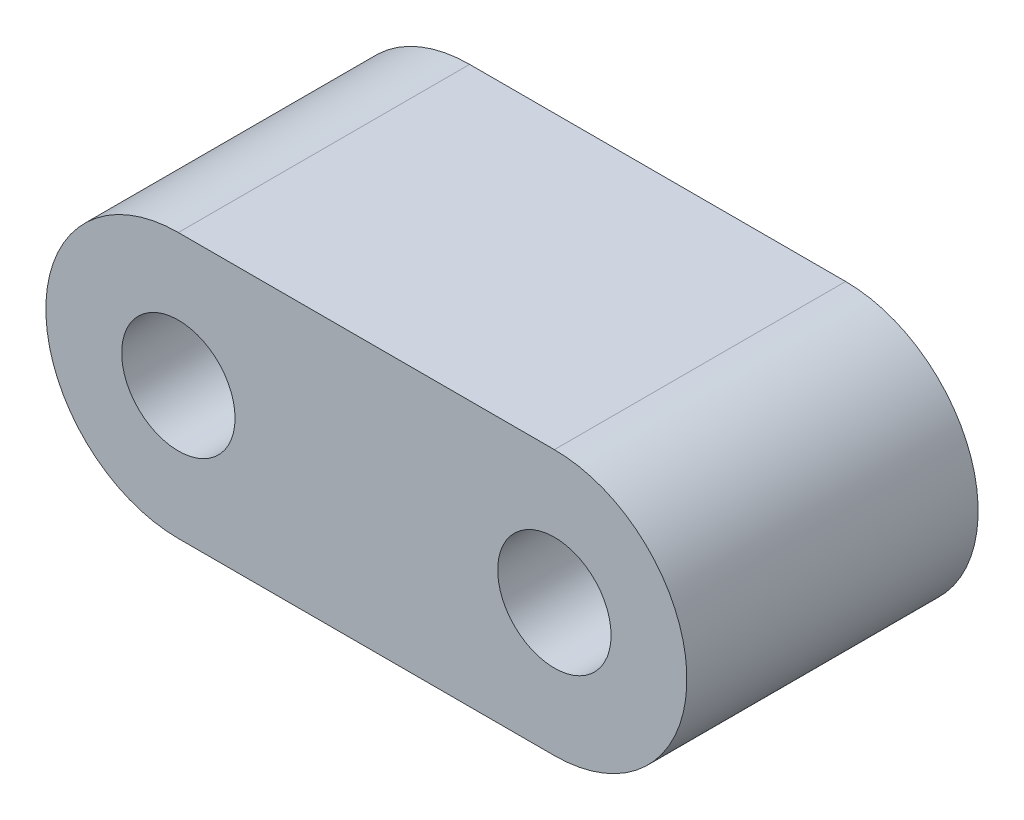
ISO-10303-21;
HEADER;
FILE_DESCRIPTION(('STEP AP214'),'2;1');
FILE_NAME('part.step','',(''),(''),'','','');
FILE_SCHEMA(('AUTOMOTIVE_DESIGN { 1 0 10303 214 1 1 1 1 }'));
ENDSEC;
DATA;
#1=APPLICATION_CONTEXT('core data for automotive mechanical design processes');
#2=APPLICATION_PROTOCOL_DEFINITION('international standard','automotive_design',2000,#1);
#3=PRODUCT_CONTEXT('',#1,'mechanical');
#4=PRODUCT('Part','Part','',(#3));
#5=PRODUCT_RELATED_PRODUCT_CATEGORY('part','',(#4));
#6=PRODUCT_DEFINITION_FORMATION('','',#4);
#7=PRODUCT_DEFINITION_CONTEXT('part definition',#1,'design');
#8=PRODUCT_DEFINITION('design','',#6,#7);
#9=PRODUCT_DEFINITION_SHAPE('','',#8);
#10=(LENGTH_UNIT() NAMED_UNIT(*) SI_UNIT(.MILLI.,.METRE.));
#11=(NAMED_UNIT(*) PLANE_ANGLE_UNIT() SI_UNIT($,.RADIAN.));
#12=(NAMED_UNIT(*) SI_UNIT($,.STERADIAN.) SOLID_ANGLE_UNIT());
#13=UNCERTAINTY_MEASURE_WITH_UNIT(LENGTH_MEASURE(1.E-05),#10,'distance_accuracy_value','');
#14=(GEOMETRIC_REPRESENTATION_CONTEXT(3) GLOBAL_UNCERTAINTY_ASSIGNED_CONTEXT((#13)) GLOBAL_UNIT_ASSIGNED_CONTEXT((#10,
#11,#12)) REPRESENTATION_CONTEXT('',''));
#15=CARTESIAN_POINT('',(0.,0.,0.));
#16=DIRECTION('',(0.,0.,1.));
#17=DIRECTION('',(1.,0.,0.));
#18=AXIS2_PLACEMENT_3D('',#15,#16,#17);
#19=CARTESIAN_POINT('',(-4.0005,0.,-3.0988));
#20=DIRECTION('',(0.,0.,1.));
#21=DIRECTION('',(1.,0.,0.));
#22=AXIS2_PLACEMENT_3D('',#19,#20,#21);
#23=CYLINDRICAL_SURFACE('',#22,2.8194);
#24=CARTESIAN_POINT('',(-4.0005,0.,3.0988));
#25=DIRECTION('',(0.,0.,1.));
#26=DIRECTION('',(1.,0.,0.));
#27=AXIS2_PLACEMENT_3D('',#24,#25,#26);
#28=CIRCLE('',#27,2.8194);
#29=CARTESIAN_POINT('',(-4.0005,2.8194,3.0988));
#30=VERTEX_POINT('',#29);
#31=CARTESIAN_POINT('',(-4.0005,-2.8194,3.0988));
#32=VERTEX_POINT('',#31);
#33=EDGE_CURVE('E97',#30,#32,#28,.T.);
#34=ORIENTED_EDGE('',*,*,#33,.F.);
#35=DIRECTION('',(0.,0.,1.));
#36=VECTOR('',#35,1.);
#37=CARTESIAN_POINT('',(-4.0005,2.8194,-3.0988));
#38=LINE('',#37,#36);
#39=CARTESIAN_POINT('',(-4.0005,2.8194,-3.0988));
#40=VERTEX_POINT('',#39);
#41=EDGE_CURVE('E11',#40,#30,#38,.T.);
#42=ORIENTED_EDGE('',*,*,#41,.F.);
#43=CARTESIAN_POINT('',(-4.0005,0.,-3.0988));
#44=DIRECTION('',(0.,0.,1.));
#45=DIRECTION('',(1.,0.,0.));
#46=AXIS2_PLACEMENT_3D('',#43,#44,#45);
#47=CIRCLE('',#46,2.8194);
#48=CARTESIAN_POINT('',(-4.0005,-2.8194,-3.0988));
#49=VERTEX_POINT('',#48);
#50=EDGE_CURVE('E90',#40,#49,#47,.T.);
#51=ORIENTED_EDGE('',*,*,#50,.T.);
#52=DIRECTION('',(0.,0.,1.));
#53=VECTOR('',#52,1.);
#54=CARTESIAN_POINT('',(-4.0005,-2.8194,-3.0988));
#55=LINE('',#54,#53);
#56=EDGE_CURVE('E35',#49,#32,#55,.T.);
#57=ORIENTED_EDGE('',*,*,#56,.T.);
#58=EDGE_LOOP('',(#34,#42,#51,#57));
#59=FACE_BOUND('',#58,.T.);
#60=ADVANCED_FACE('F32',(#59),#23,.T.);
#61=CARTESIAN_POINT('',(-4.0005,2.8194,-3.0988));
#62=DIRECTION('',(0.,1.,0.));
#63=DIRECTION('',(0.,0.,1.));
#64=AXIS2_PLACEMENT_3D('',#61,#62,#63);
#65=PLANE('',#64);
#66=DIRECTION('',(-1.,0.,0.));
#67=VECTOR('',#66,1.);
#68=CARTESIAN_POINT('',(-4.0005,2.8194,3.0988));
#69=LINE('',#68,#67);
#70=CARTESIAN_POINT('',(4.0005,2.8194,3.0988));
#71=VERTEX_POINT('',#70);
#72=EDGE_CURVE('E92',#71,#30,#69,.T.);
#73=ORIENTED_EDGE('',*,*,#72,.F.);
#74=DIRECTION('',(0.,0.,1.));
#75=VECTOR('',#74,1.);
#76=CARTESIAN_POINT('',(4.0005,2.8194,-3.0988));
#77=LINE('',#76,#75);
#78=CARTESIAN_POINT('',(4.0005,2.8194,-3.0988));
#79=VERTEX_POINT('',#78);
#80=EDGE_CURVE('E41',#79,#71,#77,.T.);
#81=ORIENTED_EDGE('',*,*,#80,.F.);
#82=DIRECTION('',(-1.,0.,0.));
#83=VECTOR('',#82,1.);
#84=CARTESIAN_POINT('',(-4.0005,2.8194,-3.0988));
#85=LINE('',#84,#83);
#86=EDGE_CURVE('E87',#79,#40,#85,.T.);
#87=ORIENTED_EDGE('',*,*,#86,.T.);
#88=ORIENTED_EDGE('',*,*,#41,.T.);
#89=EDGE_LOOP('',(#73,#81,#87,#88));
#90=FACE_BOUND('',#89,.T.);
#91=ADVANCED_FACE('F108',(#90),#65,.T.);
#92=CARTESIAN_POINT('',(4.0005,0.,-3.0988));
#93=DIRECTION('',(0.,0.,1.));
#94=DIRECTION('',(1.,0.,0.));
#95=AXIS2_PLACEMENT_3D('',#92,#93,#94);
#96=CYLINDRICAL_SURFACE('',#95,2.8194);
#97=CARTESIAN_POINT('',(4.0005,0.,3.0988));
#98=DIRECTION('',(0.,0.,1.));
#99=DIRECTION('',(1.,0.,0.));
#100=AXIS2_PLACEMENT_3D('',#97,#98,#99);
#101=CIRCLE('',#100,2.8194);
#102=CARTESIAN_POINT('',(4.0005,-2.8194,3.0988));
#103=VERTEX_POINT('',#102);
#104=EDGE_CURVE('E82',#103,#71,#101,.T.);
#105=ORIENTED_EDGE('',*,*,#104,.F.);
#106=DIRECTION('',(0.,0.,1.));
#107=VECTOR('',#106,1.);
#108=CARTESIAN_POINT('',(4.0005,-2.8194,-3.0988));
#109=LINE('',#108,#107);
#110=CARTESIAN_POINT('',(4.0005,-2.8194,-3.0988));
#111=VERTEX_POINT('',#110);
#112=EDGE_CURVE('E77',#111,#103,#109,.T.);
#113=ORIENTED_EDGE('',*,*,#112,.F.);
#114=CARTESIAN_POINT('',(4.0005,0.,-3.0988));
#115=DIRECTION('',(0.,0.,1.));
#116=DIRECTION('',(1.,0.,0.));
#117=AXIS2_PLACEMENT_3D('',#114,#115,#116);
#118=CIRCLE('',#117,2.8194);
#119=EDGE_CURVE('E80',#111,#79,#118,.T.);
#120=ORIENTED_EDGE('',*,*,#119,.T.);
#121=ORIENTED_EDGE('',*,*,#80,.T.);
#122=EDGE_LOOP('',(#105,#113,#120,#121));
#123=FACE_BOUND('',#122,.T.);
#124=ADVANCED_FACE('F79',(#123),#96,.T.);
#125=CARTESIAN_POINT('',(-4.0005,-2.8194,-3.0988));
#126=DIRECTION('',(0.,-1.,0.));
#127=DIRECTION('',(0.,0.,-1.));
#128=AXIS2_PLACEMENT_3D('',#125,#126,#127);
#129=PLANE('',#128);
#130=DIRECTION('',(1.,0.,0.));
#131=VECTOR('',#130,1.);
#132=CARTESIAN_POINT('',(-4.0005,-2.8194,3.0988));
#133=LINE('',#132,#131);
#134=EDGE_CURVE('E100',#32,#103,#133,.T.);
#135=ORIENTED_EDGE('',*,*,#134,.F.);
#136=ORIENTED_EDGE('',*,*,#56,.F.);
#137=DIRECTION('',(1.,0.,0.));
#138=VECTOR('',#137,1.);
#139=CARTESIAN_POINT('',(-4.0005,-2.8194,-3.0988));
#140=LINE('',#139,#138);
#141=EDGE_CURVE('E86',#49,#111,#140,.T.);
#142=ORIENTED_EDGE('',*,*,#141,.T.);
#143=ORIENTED_EDGE('',*,*,#112,.T.);
#144=EDGE_LOOP('',(#135,#136,#142,#143));
#145=FACE_BOUND('',#144,.T.);
#146=ADVANCED_FACE('F89',(#145),#129,.T.);
#147=CARTESIAN_POINT('',(-4.0005,0.,-3.0988));
#148=DIRECTION('',(0.,0.,1.));
#149=DIRECTION('',(1.,0.,0.));
#150=AXIS2_PLACEMENT_3D('',#147,#148,#149);
#151=PLANE('',#150);
#152=CARTESIAN_POINT('',(4.0005,0.,-3.0988));
#153=DIRECTION('',(0.,0.,1.));
#154=DIRECTION('',(1.,0.,0.));
#155=AXIS2_PLACEMENT_3D('',#152,#153,#154);
#156=CIRCLE('',#155,1.2065);
#157=CARTESIAN_POINT('',(5.207,0.,-3.0988));
#158=VERTEX_POINT('',#157);
#159=EDGE_CURVE('E141',#158,#158,#156,.T.);
#160=ORIENTED_EDGE('',*,*,#159,.T.);
#161=EDGE_LOOP('',(#160));
#162=FACE_BOUND('',#161,.T.);
#163=CARTESIAN_POINT('',(-4.0005,0.,-3.0988));
#164=DIRECTION('',(0.,0.,1.));
#165=DIRECTION('',(1.,0.,0.));
#166=AXIS2_PLACEMENT_3D('',#163,#164,#165);
#167=CIRCLE('',#166,1.2065);
#168=CARTESIAN_POINT('',(-2.794,0.,-3.0988));
#169=VERTEX_POINT('',#168);
#170=EDGE_CURVE('E101',#169,#169,#167,.T.);
#171=ORIENTED_EDGE('',*,*,#170,.T.);
#172=EDGE_LOOP('',(#171));
#173=FACE_BOUND('',#172,.T.);
#174=ORIENTED_EDGE('',*,*,#50,.F.);
#175=ORIENTED_EDGE('',*,*,#86,.F.);
#176=ORIENTED_EDGE('',*,*,#119,.F.);
#177=ORIENTED_EDGE('',*,*,#141,.F.);
#178=EDGE_LOOP('',(#174,#175,#176,#177));
#179=FACE_BOUND('',#178,.T.);
#180=ADVANCED_FACE('F85',(#162,#173,#179),#151,.F.);
#181=CARTESIAN_POINT('',(-4.0005,0.,3.0988));
#182=DIRECTION('',(0.,0.,1.));
#183=DIRECTION('',(1.,0.,0.));
#184=AXIS2_PLACEMENT_3D('',#181,#182,#183);
#185=PLANE('',#184);
#186=CARTESIAN_POINT('',(4.0005,0.,3.0988));
#187=DIRECTION('',(0.,0.,1.));
#188=DIRECTION('',(1.,0.,0.));
#189=AXIS2_PLACEMENT_3D('',#186,#187,#188);
#190=CIRCLE('',#189,1.2065);
#191=CARTESIAN_POINT('',(5.207,0.,3.0988));
#192=VERTEX_POINT('',#191);
#193=EDGE_CURVE('E144',#192,#192,#190,.T.);
#194=ORIENTED_EDGE('',*,*,#193,.F.);
#195=EDGE_LOOP('',(#194));
#196=FACE_BOUND('',#195,.T.);
#197=CARTESIAN_POINT('',(-4.0005,0.,3.0988));
#198=DIRECTION('',(0.,0.,1.));
#199=DIRECTION('',(1.,0.,0.));
#200=AXIS2_PLACEMENT_3D('',#197,#198,#199);
#201=CIRCLE('',#200,1.2065);
#202=CARTESIAN_POINT('',(-2.794,0.,3.0988));
#203=VERTEX_POINT('',#202);
#204=EDGE_CURVE('E146',#203,#203,#201,.T.);
#205=ORIENTED_EDGE('',*,*,#204,.F.);
#206=EDGE_LOOP('',(#205));
#207=FACE_BOUND('',#206,.T.);
#208=ORIENTED_EDGE('',*,*,#33,.T.);
#209=ORIENTED_EDGE('',*,*,#134,.T.);
#210=ORIENTED_EDGE('',*,*,#104,.T.);
#211=ORIENTED_EDGE('',*,*,#72,.T.);
#212=EDGE_LOOP('',(#208,#209,#210,#211));
#213=FACE_BOUND('',#212,.T.);
#214=ADVANCED_FACE('F107',(#196,#207,#213),#185,.T.);
#215=CARTESIAN_POINT('',(-4.0005,0.,-3.0988));
#216=DIRECTION('',(0.,0.,1.));
#217=DIRECTION('',(1.,0.,0.));
#218=AXIS2_PLACEMENT_3D('',#215,#216,#217);
#219=CYLINDRICAL_SURFACE('',#218,1.2065);
#220=ORIENTED_EDGE('',*,*,#170,.F.);
#221=EDGE_LOOP('',(#220));
#222=FACE_BOUND('',#221,.T.);
#223=ORIENTED_EDGE('',*,*,#204,.T.);
#224=EDGE_LOOP('',(#223));
#225=FACE_BOUND('',#224,.T.);
#226=ADVANCED_FACE('F126',(#222,#225),#219,.F.);
#227=CARTESIAN_POINT('',(4.0005,0.,-3.0988));
#228=DIRECTION('',(0.,0.,1.));
#229=DIRECTION('',(1.,0.,0.));
#230=AXIS2_PLACEMENT_3D('',#227,#228,#229);
#231=CYLINDRICAL_SURFACE('',#230,1.2065);
#232=ORIENTED_EDGE('',*,*,#159,.F.);
#233=EDGE_LOOP('',(#232));
#234=FACE_BOUND('',#233,.T.);
#235=ORIENTED_EDGE('',*,*,#193,.T.);
#236=EDGE_LOOP('',(#235));
#237=FACE_BOUND('',#236,.T.);
#238=ADVANCED_FACE('F133',(#234,#237),#231,.F.);
#239=CLOSED_SHELL('',(#60,#91,#124,#146,#180,#214,#226,#238));
#240=MANIFOLD_SOLID_BREP('B2',#239);
#241=ADVANCED_BREP_SHAPE_REPRESENTATION('',(#18,#240),#14);
#242=SHAPE_DEFINITION_REPRESENTATION(#9,#241);
ENDSEC;
END-ISO-10303-21;
